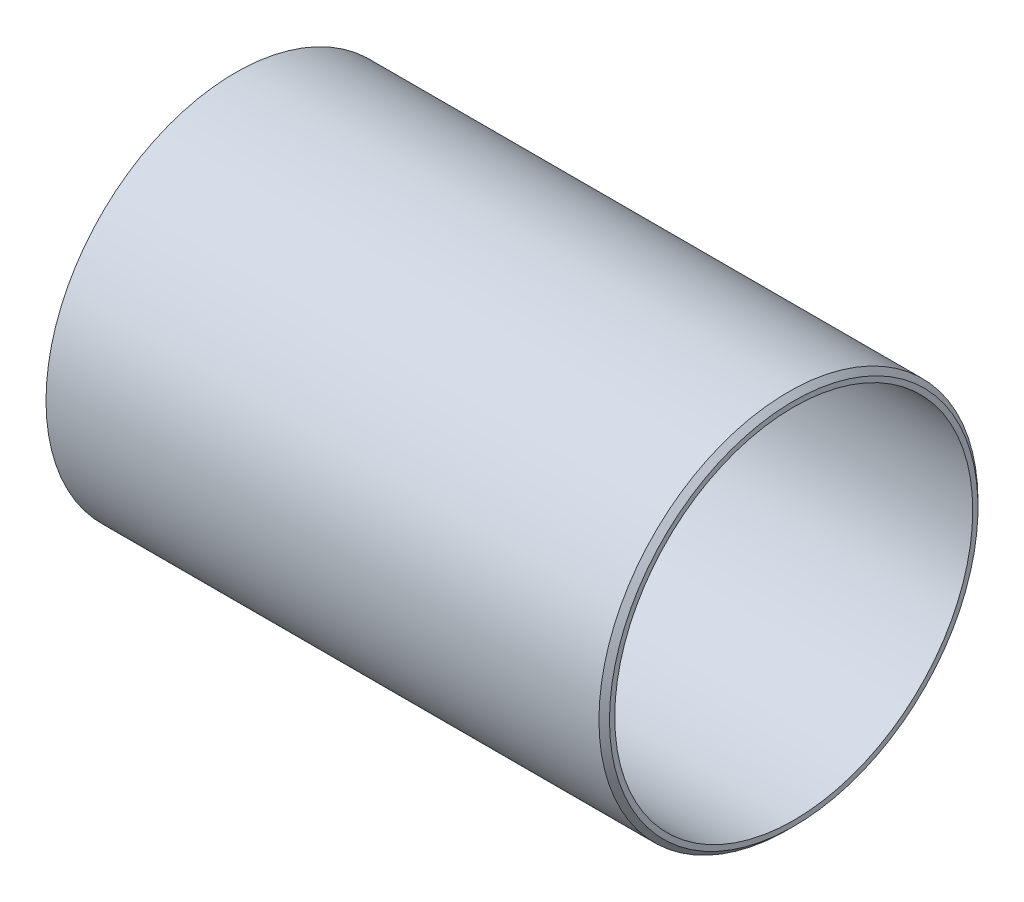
ISO-10303-21;
HEADER;
FILE_DESCRIPTION(('STEP AP214'),'2;1');
FILE_NAME('part.step','',(''),(''),'','','');
FILE_SCHEMA(('AUTOMOTIVE_DESIGN { 1 0 10303 214 1 1 1 1 }'));
ENDSEC;
DATA;
#1=APPLICATION_CONTEXT('core data for automotive mechanical design processes');
#2=APPLICATION_PROTOCOL_DEFINITION('international standard','automotive_design',2000,#1);
#3=PRODUCT_CONTEXT('',#1,'mechanical');
#4=PRODUCT('Part','Part','',(#3));
#5=PRODUCT_RELATED_PRODUCT_CATEGORY('part','',(#4));
#6=PRODUCT_DEFINITION_FORMATION('','',#4);
#7=PRODUCT_DEFINITION_CONTEXT('part definition',#1,'design');
#8=PRODUCT_DEFINITION('design','',#6,#7);
#9=PRODUCT_DEFINITION_SHAPE('','',#8);
#10=(LENGTH_UNIT() NAMED_UNIT(*) SI_UNIT(.MILLI.,.METRE.));
#11=(NAMED_UNIT(*) PLANE_ANGLE_UNIT() SI_UNIT($,.RADIAN.));
#12=(NAMED_UNIT(*) SI_UNIT($,.STERADIAN.) SOLID_ANGLE_UNIT());
#13=UNCERTAINTY_MEASURE_WITH_UNIT(LENGTH_MEASURE(1.E-05),#10,'distance_accuracy_value','');
#14=(GEOMETRIC_REPRESENTATION_CONTEXT(3) GLOBAL_UNCERTAINTY_ASSIGNED_CONTEXT((#13)) GLOBAL_UNIT_ASSIGNED_CONTEXT((#10,
#11,#12)) REPRESENTATION_CONTEXT('',''));
#15=CARTESIAN_POINT('',(0.,0.,0.));
#16=DIRECTION('',(0.,0.,1.));
#17=DIRECTION('',(1.,0.,0.));
#18=AXIS2_PLACEMENT_3D('',#15,#16,#17);
#19=CARTESIAN_POINT('',(0.,0.,0.));
#20=DIRECTION('',(-1.,0.,0.));
#21=DIRECTION('',(0.,0.,1.));
#22=AXIS2_PLACEMENT_3D('',#19,#20,#21);
#23=PLANE('',#22);
#24=CARTESIAN_POINT('',(0.,0.,0.));
#25=DIRECTION('',(-1.,0.,0.));
#26=DIRECTION('',(0.,0.,1.));
#27=AXIS2_PLACEMENT_3D('',#24,#25,#26);
#28=CIRCLE('',#27,111.125);
#29=CARTESIAN_POINT('',(0.,0.,111.125));
#30=VERTEX_POINT('',#29);
#31=EDGE_CURVE('E10',#30,#30,#28,.F.);
#32=ORIENTED_EDGE('',*,*,#31,.T.);
#33=EDGE_LOOP('',(#32));
#34=FACE_BOUND('',#33,.T.);
#35=CARTESIAN_POINT('',(0.,0.,0.));
#36=DIRECTION('',(-1.,0.,0.));
#37=DIRECTION('',(0.,0.,1.));
#38=AXIS2_PLACEMENT_3D('',#35,#36,#37);
#39=CIRCLE('',#38,107.95);
#40=CARTESIAN_POINT('',(0.,0.,107.95));
#41=VERTEX_POINT('',#40);
#42=EDGE_CURVE('E54',#41,#41,#39,.T.);
#43=ORIENTED_EDGE('',*,*,#42,.T.);
#44=EDGE_LOOP('',(#43));
#45=FACE_BOUND('',#44,.T.);
#46=ADVANCED_FACE('F34',(#34,#45),#23,.F.);
#47=CARTESIAN_POINT('',(-678.989220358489,0.,0.));
#48=DIRECTION('',(1.,0.,0.));
#49=DIRECTION('',(0.,0.,-1.));
#50=AXIS2_PLACEMENT_3D('',#47,#48,#49);
#51=CYLINDRICAL_SURFACE('',#50,114.3);
#52=CARTESIAN_POINT('',(-3.17499999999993,0.,0.));
#53=DIRECTION('',(-1.,0.,0.));
#54=DIRECTION('',(0.,0.,1.));
#55=AXIS2_PLACEMENT_3D('',#52,#53,#54);
#56=CIRCLE('',#55,114.3);
#57=CARTESIAN_POINT('',(-3.17499999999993,0.,114.3));
#58=VERTEX_POINT('',#57);
#59=EDGE_CURVE('E41',#58,#58,#56,.T.);
#60=ORIENTED_EDGE('',*,*,#59,.T.);
#61=EDGE_LOOP('',(#60));
#62=FACE_BOUND('',#61,.T.);
#63=CARTESIAN_POINT('',(-336.65,0.,0.));
#64=DIRECTION('',(1.,0.,0.));
#65=DIRECTION('',(0.,0.,-1.));
#66=AXIS2_PLACEMENT_3D('',#63,#64,#65);
#67=CIRCLE('',#66,114.3);
#68=CARTESIAN_POINT('',(-336.65,0.,-114.3));
#69=VERTEX_POINT('',#68);
#70=EDGE_CURVE('E49',#69,#69,#67,.T.);
#71=ORIENTED_EDGE('',*,*,#70,.T.);
#72=EDGE_LOOP('',(#71));
#73=FACE_BOUND('',#72,.T.);
#74=ADVANCED_FACE('F62',(#62,#73),#51,.T.);
#75=CARTESIAN_POINT('',(-678.989220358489,0.,0.));
#76=DIRECTION('',(1.,0.,0.));
#77=DIRECTION('',(0.,0.,-1.));
#78=AXIS2_PLACEMENT_3D('',#75,#76,#77);
#79=CYLINDRICAL_SURFACE('',#78,107.95);
#80=CARTESIAN_POINT('',(-336.65,0.,0.));
#81=DIRECTION('',(1.,0.,0.));
#82=DIRECTION('',(0.,0.,-1.));
#83=AXIS2_PLACEMENT_3D('',#80,#81,#82);
#84=CIRCLE('',#83,107.95);
#85=CARTESIAN_POINT('',(-336.65,0.,-107.95));
#86=VERTEX_POINT('',#85);
#87=EDGE_CURVE('E45',#86,#86,#84,.T.);
#88=ORIENTED_EDGE('',*,*,#87,.F.);
#89=EDGE_LOOP('',(#88));
#90=FACE_BOUND('',#89,.T.);
#91=ORIENTED_EDGE('',*,*,#42,.F.);
#92=EDGE_LOOP('',(#91));
#93=FACE_BOUND('',#92,.T.);
#94=ADVANCED_FACE('F59',(#90,#93),#79,.F.);
#95=CARTESIAN_POINT('',(-336.65,-280.963441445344,419.100000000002));
#96=DIRECTION('',(1.,0.,0.));
#97=DIRECTION('',(0.,0.,-1.));
#98=AXIS2_PLACEMENT_3D('',#95,#96,#97);
#99=PLANE('',#98);
#100=ORIENTED_EDGE('',*,*,#87,.T.);
#101=EDGE_LOOP('',(#100));
#102=FACE_BOUND('',#101,.T.);
#103=ORIENTED_EDGE('',*,*,#70,.F.);
#104=EDGE_LOOP('',(#103));
#105=FACE_BOUND('',#104,.T.);
#106=ADVANCED_FACE('F61',(#102,#105),#99,.F.);
#107=CARTESIAN_POINT('',(-3.17499999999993,0.,0.));
#108=DIRECTION('',(-1.,0.,0.));
#109=DIRECTION('',(0.,0.,1.));
#110=AXIS2_PLACEMENT_3D('',#107,#108,#109);
#111=CONICAL_SURFACE('',#110,114.3,0.785398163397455);
#112=ORIENTED_EDGE('',*,*,#31,.F.);
#113=EDGE_LOOP('',(#112));
#114=FACE_BOUND('',#113,.T.);
#115=ORIENTED_EDGE('',*,*,#59,.F.);
#116=EDGE_LOOP('',(#115));
#117=FACE_BOUND('',#116,.T.);
#118=ADVANCED_FACE('F36',(#114,#117),#111,.T.);
#119=CLOSED_SHELL('',(#46,#74,#94,#106,#118));
#120=MANIFOLD_SOLID_BREP('B2',#119);
#121=ADVANCED_BREP_SHAPE_REPRESENTATION('',(#18,#120),#14);
#122=SHAPE_DEFINITION_REPRESENTATION(#9,#121);
ENDSEC;
END-ISO-10303-21;
